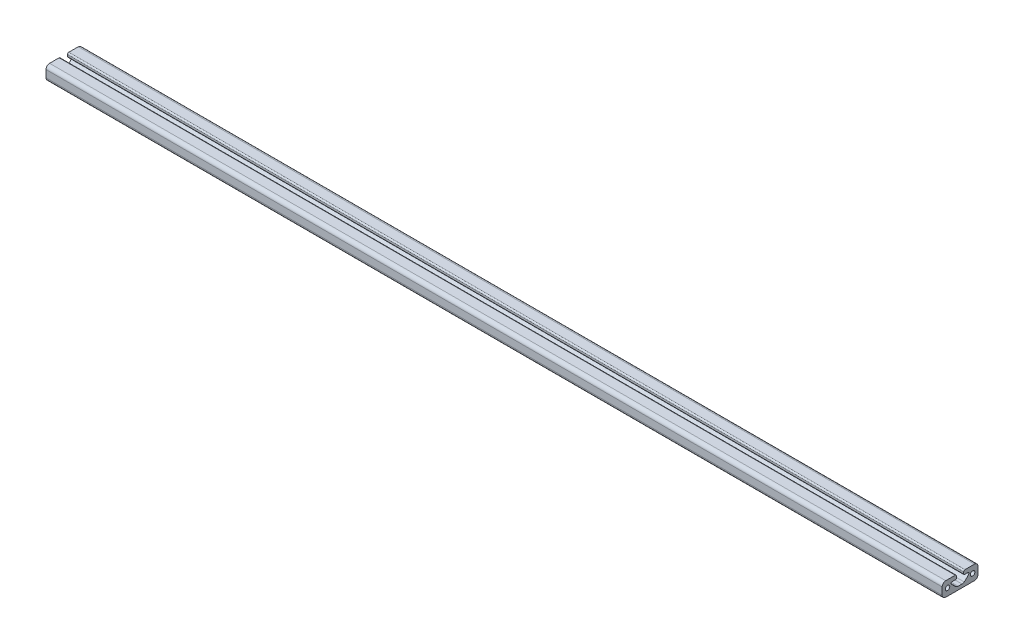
ISO-10303-21;
HEADER;
FILE_DESCRIPTION(('STEP AP214'),'2;1');
FILE_NAME('part.step','',(''),(''),'','','');
FILE_SCHEMA(('AUTOMOTIVE_DESIGN { 1 0 10303 214 1 1 1 1 }'));
ENDSEC;
DATA;
#1=APPLICATION_CONTEXT('core data for automotive mechanical design processes');
#2=APPLICATION_PROTOCOL_DEFINITION('international standard','automotive_design',2000,#1);
#3=PRODUCT_CONTEXT('',#1,'mechanical');
#4=PRODUCT('Part','Part','',(#3));
#5=PRODUCT_RELATED_PRODUCT_CATEGORY('part','',(#4));
#6=PRODUCT_DEFINITION_FORMATION('','',#4);
#7=PRODUCT_DEFINITION_CONTEXT('part definition',#1,'design');
#8=PRODUCT_DEFINITION('design','',#6,#7);
#9=PRODUCT_DEFINITION_SHAPE('','',#8);
#10=(LENGTH_UNIT() NAMED_UNIT(*) SI_UNIT(.MILLI.,.METRE.));
#11=(NAMED_UNIT(*) PLANE_ANGLE_UNIT() SI_UNIT($,.RADIAN.));
#12=(NAMED_UNIT(*) SI_UNIT($,.STERADIAN.) SOLID_ANGLE_UNIT());
#13=UNCERTAINTY_MEASURE_WITH_UNIT(LENGTH_MEASURE(1.E-05),#10,'distance_accuracy_value','');
#14=(GEOMETRIC_REPRESENTATION_CONTEXT(3) GLOBAL_UNCERTAINTY_ASSIGNED_CONTEXT((#13)) GLOBAL_UNIT_ASSIGNED_CONTEXT((#10,
#11,#12)) REPRESENTATION_CONTEXT('',''));
#15=CARTESIAN_POINT('',(0.,0.,0.));
#16=DIRECTION('',(0.,0.,1.));
#17=DIRECTION('',(1.,0.,0.));
#18=AXIS2_PLACEMENT_3D('',#15,#16,#17);
#19=CARTESIAN_POINT('',(1000.,2.41611505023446,8.91611505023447));
#20=DIRECTION('',(-1.,0.,0.));
#21=DIRECTION('',(0.,0.,1.));
#22=AXIS2_PLACEMENT_3D('',#19,#20,#21);
#23=CYLINDRICAL_SURFACE('',#22,1.08388494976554);
#24=CARTESIAN_POINT('',(0.,2.41611505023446,8.91611505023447));
#25=DIRECTION('',(-1.,0.,0.));
#26=DIRECTION('',(0.,0.,-1.));
#27=AXIS2_PLACEMENT_3D('',#24,#25,#26);
#28=CIRCLE('',#27,1.08388494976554);
#29=CARTESIAN_POINT('',(0.,1.77329746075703,9.78880751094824));
#30=VERTEX_POINT('',#29);
#31=CARTESIAN_POINT('',(0.,3.5,8.91611505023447));
#32=VERTEX_POINT('',#31);
#33=EDGE_CURVE('E311',#30,#32,#28,.T.);
#34=ORIENTED_EDGE('',*,*,#33,.T.);
#35=DIRECTION('',(-1.,0.,0.));
#36=VECTOR('',#35,1.);
#37=CARTESIAN_POINT('',(1000.,3.5,8.91611505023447));
#38=LINE('',#37,#36);
#39=CARTESIAN_POINT('',(1000.,3.5,8.91611505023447));
#40=VERTEX_POINT('',#39);
#41=EDGE_CURVE('E12',#40,#32,#38,.T.);
#42=ORIENTED_EDGE('',*,*,#41,.F.);
#43=CARTESIAN_POINT('',(1000.,2.41611505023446,8.91611505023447));
#44=DIRECTION('',(-1.,0.,0.));
#45=DIRECTION('',(0.,0.,-1.));
#46=AXIS2_PLACEMENT_3D('',#43,#44,#45);
#47=CIRCLE('',#46,1.08388494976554);
#48=CARTESIAN_POINT('',(1000.,1.77329746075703,9.78880751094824));
#49=VERTEX_POINT('',#48);
#50=EDGE_CURVE('E484',#49,#40,#47,.T.);
#51=ORIENTED_EDGE('',*,*,#50,.F.);
#52=DIRECTION('',(-1.,0.,0.));
#53=VECTOR('',#52,1.);
#54=CARTESIAN_POINT('',(1000.,1.77329746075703,9.78880751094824));
#55=LINE('',#54,#53);
#56=EDGE_CURVE('E301',#49,#30,#55,.T.);
#57=ORIENTED_EDGE('',*,*,#56,.T.);
#58=EDGE_LOOP('',(#34,#42,#51,#57));
#59=FACE_BOUND('',#58,.T.);
#60=ADVANCED_FACE('F112',(#59),#23,.F.);
#61=CARTESIAN_POINT('',(1000.,3.5,8.91611505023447));
#62=DIRECTION('',(0.,1.,0.));
#63=DIRECTION('',(0.,0.,1.));
#64=AXIS2_PLACEMENT_3D('',#61,#62,#63);
#65=PLANE('',#64);
#66=DIRECTION('',(0.,0.,-1.));
#67=VECTOR('',#66,1.);
#68=CARTESIAN_POINT('',(0.,3.5,8.91611505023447));
#69=LINE('',#68,#67);
#70=CARTESIAN_POINT('',(0.,3.49999999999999,5.));
#71=VERTEX_POINT('',#70);
#72=EDGE_CURVE('E314',#32,#71,#69,.T.);
#73=ORIENTED_EDGE('',*,*,#72,.T.);
#74=DIRECTION('',(-1.,0.,0.));
#75=VECTOR('',#74,1.);
#76=CARTESIAN_POINT('',(1000.,3.49999999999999,5.));
#77=LINE('',#76,#75);
#78=CARTESIAN_POINT('',(1000.,3.49999999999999,5.));
#79=VERTEX_POINT('',#78);
#80=EDGE_CURVE('E121',#79,#71,#77,.T.);
#81=ORIENTED_EDGE('',*,*,#80,.F.);
#82=DIRECTION('',(0.,0.,-1.));
#83=VECTOR('',#82,1.);
#84=CARTESIAN_POINT('',(1000.,3.5,8.91611505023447));
#85=LINE('',#84,#83);
#86=EDGE_CURVE('E220',#40,#79,#85,.T.);
#87=ORIENTED_EDGE('',*,*,#86,.F.);
#88=ORIENTED_EDGE('',*,*,#41,.T.);
#89=EDGE_LOOP('',(#73,#81,#87,#88));
#90=FACE_BOUND('',#89,.T.);
#91=ADVANCED_FACE('F499',(#90),#65,.F.);
#92=CARTESIAN_POINT('',(1000.,4.49999999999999,5.));
#93=DIRECTION('',(-1.,0.,0.));
#94=DIRECTION('',(0.,0.,1.));
#95=AXIS2_PLACEMENT_3D('',#92,#93,#94);
#96=CYLINDRICAL_SURFACE('',#95,1.);
#97=CARTESIAN_POINT('',(0.,4.49999999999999,5.));
#98=DIRECTION('',(1.,0.,0.));
#99=DIRECTION('',(0.,0.,-1.));
#100=AXIS2_PLACEMENT_3D('',#97,#98,#99);
#101=CIRCLE('',#100,1.);
#102=CARTESIAN_POINT('',(0.,4.49999999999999,4.));
#103=VERTEX_POINT('',#102);
#104=EDGE_CURVE('E316',#71,#103,#101,.T.);
#105=ORIENTED_EDGE('',*,*,#104,.T.);
#106=DIRECTION('',(-1.,0.,0.));
#107=VECTOR('',#106,1.);
#108=CARTESIAN_POINT('',(1000.,4.49999999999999,4.));
#109=LINE('',#108,#107);
#110=CARTESIAN_POINT('',(1000.,4.49999999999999,4.));
#111=VERTEX_POINT('',#110);
#112=EDGE_CURVE('E412',#111,#103,#109,.T.);
#113=ORIENTED_EDGE('',*,*,#112,.F.);
#114=CARTESIAN_POINT('',(1000.,4.49999999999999,5.));
#115=DIRECTION('',(1.,0.,0.));
#116=DIRECTION('',(0.,0.,-1.));
#117=AXIS2_PLACEMENT_3D('',#114,#115,#116);
#118=CIRCLE('',#117,1.);
#119=EDGE_CURVE('E420',#79,#111,#118,.T.);
#120=ORIENTED_EDGE('',*,*,#119,.F.);
#121=ORIENTED_EDGE('',*,*,#80,.T.);
#122=EDGE_LOOP('',(#105,#113,#120,#121));
#123=FACE_BOUND('',#122,.T.);
#124=ADVANCED_FACE('F418',(#123),#96,.T.);
#125=CARTESIAN_POINT('',(1000.,4.49999999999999,4.));
#126=DIRECTION('',(0.,0.,1.));
#127=DIRECTION('',(0.,-1.,0.));
#128=AXIS2_PLACEMENT_3D('',#125,#126,#127);
#129=PLANE('',#128);
#130=DIRECTION('',(0.,1.,0.));
#131=VECTOR('',#130,1.);
#132=CARTESIAN_POINT('',(0.,4.49999999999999,4.));
#133=LINE('',#132,#131);
#134=CARTESIAN_POINT('',(0.,6.49999999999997,4.));
#135=VERTEX_POINT('',#134);
#136=EDGE_CURVE('E318',#103,#135,#133,.T.);
#137=ORIENTED_EDGE('',*,*,#136,.T.);
#138=DIRECTION('',(-1.,0.,0.));
#139=VECTOR('',#138,1.);
#140=CARTESIAN_POINT('',(1000.,6.49999999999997,4.));
#141=LINE('',#140,#139);
#142=CARTESIAN_POINT('',(1000.,6.49999999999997,4.));
#143=VERTEX_POINT('',#142);
#144=EDGE_CURVE('E409',#143,#135,#141,.T.);
#145=ORIENTED_EDGE('',*,*,#144,.F.);
#146=DIRECTION('',(0.,1.,0.));
#147=VECTOR('',#146,1.);
#148=CARTESIAN_POINT('',(1000.,4.49999999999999,4.));
#149=LINE('',#148,#147);
#150=EDGE_CURVE('E438',#111,#143,#149,.T.);
#151=ORIENTED_EDGE('',*,*,#150,.F.);
#152=ORIENTED_EDGE('',*,*,#112,.T.);
#153=EDGE_LOOP('',(#137,#145,#151,#152));
#154=FACE_BOUND('',#153,.T.);
#155=ADVANCED_FACE('F429',(#154),#129,.F.);
#156=CARTESIAN_POINT('',(1000.,6.49999999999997,5.5));
#157=DIRECTION('',(-1.,0.,0.));
#158=DIRECTION('',(0.,0.,1.));
#159=AXIS2_PLACEMENT_3D('',#156,#157,#158);
#160=CYLINDRICAL_SURFACE('',#159,1.5);
#161=CARTESIAN_POINT('',(0.,6.49999999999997,5.5));
#162=DIRECTION('',(1.,0.,0.));
#163=DIRECTION('',(0.,0.,-1.));
#164=AXIS2_PLACEMENT_3D('',#161,#162,#163);
#165=CIRCLE('',#164,1.5);
#166=CARTESIAN_POINT('',(0.,7.99999999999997,5.5));
#167=VERTEX_POINT('',#166);
#168=EDGE_CURVE('E320',#135,#167,#165,.T.);
#169=ORIENTED_EDGE('',*,*,#168,.T.);
#170=DIRECTION('',(-1.,0.,0.));
#171=VECTOR('',#170,1.);
#172=CARTESIAN_POINT('',(1000.,7.99999999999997,5.5));
#173=LINE('',#172,#171);
#174=CARTESIAN_POINT('',(1000.,7.99999999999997,5.5));
#175=VERTEX_POINT('',#174);
#176=EDGE_CURVE('E406',#175,#167,#173,.T.);
#177=ORIENTED_EDGE('',*,*,#176,.F.);
#178=CARTESIAN_POINT('',(1000.,6.49999999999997,5.5));
#179=DIRECTION('',(1.,0.,0.));
#180=DIRECTION('',(0.,0.,-1.));
#181=AXIS2_PLACEMENT_3D('',#178,#179,#180);
#182=CIRCLE('',#181,1.5);
#183=EDGE_CURVE('E435',#143,#175,#182,.T.);
#184=ORIENTED_EDGE('',*,*,#183,.F.);
#185=ORIENTED_EDGE('',*,*,#144,.T.);
#186=EDGE_LOOP('',(#169,#177,#184,#185));
#187=FACE_BOUND('',#186,.T.);
#188=ADVANCED_FACE('F433',(#187),#160,.T.);
#189=CARTESIAN_POINT('',(1000.,7.99999999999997,5.5));
#190=DIRECTION('',(0.,-1.,0.));
#191=DIRECTION('',(0.,0.,-1.));
#192=AXIS2_PLACEMENT_3D('',#189,#190,#191);
#193=PLANE('',#192);
#194=DIRECTION('',(0.,0.,1.));
#195=VECTOR('',#194,1.);
#196=CARTESIAN_POINT('',(0.,7.99999999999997,5.5));
#197=LINE('',#196,#195);
#198=CARTESIAN_POINT('',(0.,8.,16.));
#199=VERTEX_POINT('',#198);
#200=EDGE_CURVE('E322',#167,#199,#197,.T.);
#201=ORIENTED_EDGE('',*,*,#200,.T.);
#202=DIRECTION('',(-1.,0.,0.));
#203=VECTOR('',#202,1.);
#204=CARTESIAN_POINT('',(1000.,8.,16.));
#205=LINE('',#204,#203);
#206=CARTESIAN_POINT('',(1000.,8.,16.));
#207=VERTEX_POINT('',#206);
#208=EDGE_CURVE('E403',#207,#199,#205,.T.);
#209=ORIENTED_EDGE('',*,*,#208,.F.);
#210=DIRECTION('',(0.,0.,1.));
#211=VECTOR('',#210,1.);
#212=CARTESIAN_POINT('',(1000.,7.99999999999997,5.5));
#213=LINE('',#212,#211);
#214=EDGE_CURVE('E437',#175,#207,#213,.T.);
#215=ORIENTED_EDGE('',*,*,#214,.F.);
#216=ORIENTED_EDGE('',*,*,#176,.T.);
#217=EDGE_LOOP('',(#201,#209,#215,#216));
#218=FACE_BOUND('',#217,.T.);
#219=ADVANCED_FACE('F721',(#218),#193,.F.);
#220=CARTESIAN_POINT('',(1000.,4.,16.));
#221=DIRECTION('',(-1.,0.,0.));
#222=DIRECTION('',(0.,0.,1.));
#223=AXIS2_PLACEMENT_3D('',#220,#221,#222);
#224=CYLINDRICAL_SURFACE('',#223,4.);
#225=CARTESIAN_POINT('',(0.,4.,16.));
#226=DIRECTION('',(1.,0.,0.));
#227=DIRECTION('',(0.,0.,-1.));
#228=AXIS2_PLACEMENT_3D('',#225,#226,#227);
#229=CIRCLE('',#228,4.);
#230=CARTESIAN_POINT('',(0.,4.,20.));
#231=VERTEX_POINT('',#230);
#232=EDGE_CURVE('E324',#199,#231,#229,.T.);
#233=ORIENTED_EDGE('',*,*,#232,.T.);
#234=DIRECTION('',(-1.,0.,0.));
#235=VECTOR('',#234,1.);
#236=CARTESIAN_POINT('',(1000.,4.,20.));
#237=LINE('',#236,#235);
#238=CARTESIAN_POINT('',(1000.,4.,20.));
#239=VERTEX_POINT('',#238);
#240=EDGE_CURVE('E400',#239,#231,#237,.T.);
#241=ORIENTED_EDGE('',*,*,#240,.F.);
#242=CARTESIAN_POINT('',(1000.,4.,16.));
#243=DIRECTION('',(1.,0.,0.));
#244=DIRECTION('',(0.,0.,-1.));
#245=AXIS2_PLACEMENT_3D('',#242,#243,#244);
#246=CIRCLE('',#245,4.);
#247=EDGE_CURVE('E440',#207,#239,#246,.T.);
#248=ORIENTED_EDGE('',*,*,#247,.F.);
#249=ORIENTED_EDGE('',*,*,#208,.T.);
#250=EDGE_LOOP('',(#233,#241,#248,#249));
#251=FACE_BOUND('',#250,.T.);
#252=ADVANCED_FACE('F710',(#251),#224,.T.);
#253=CARTESIAN_POINT('',(1000.,4.,20.));
#254=DIRECTION('',(0.,0.,-1.));
#255=DIRECTION('',(-1.,0.,0.));
#256=AXIS2_PLACEMENT_3D('',#253,#254,#255);
#257=PLANE('',#256);
#258=DIRECTION('',(0.,-1.,0.));
#259=VECTOR('',#258,1.);
#260=CARTESIAN_POINT('',(0.,4.,20.));
#261=LINE('',#260,#259);
#262=CARTESIAN_POINT('',(0.,-4.,20.));
#263=VERTEX_POINT('',#262);
#264=EDGE_CURVE('E326',#231,#263,#261,.T.);
#265=ORIENTED_EDGE('',*,*,#264,.T.);
#266=DIRECTION('',(-1.,0.,0.));
#267=VECTOR('',#266,1.);
#268=CARTESIAN_POINT('',(1000.,-4.,20.));
#269=LINE('',#268,#267);
#270=CARTESIAN_POINT('',(1000.,-4.,20.));
#271=VERTEX_POINT('',#270);
#272=EDGE_CURVE('E397',#271,#263,#269,.T.);
#273=ORIENTED_EDGE('',*,*,#272,.F.);
#274=DIRECTION('',(0.,-1.,0.));
#275=VECTOR('',#274,1.);
#276=CARTESIAN_POINT('',(1000.,4.,20.));
#277=LINE('',#276,#275);
#278=EDGE_CURVE('E446',#239,#271,#277,.T.);
#279=ORIENTED_EDGE('',*,*,#278,.F.);
#280=ORIENTED_EDGE('',*,*,#240,.T.);
#281=EDGE_LOOP('',(#265,#273,#279,#280));
#282=FACE_BOUND('',#281,.T.);
#283=ADVANCED_FACE('F699',(#282),#257,.F.);
#284=CARTESIAN_POINT('',(1000.,-4.,16.));
#285=DIRECTION('',(-1.,0.,0.));
#286=DIRECTION('',(0.,0.,1.));
#287=AXIS2_PLACEMENT_3D('',#284,#285,#286);
#288=CYLINDRICAL_SURFACE('',#287,4.);
#289=CARTESIAN_POINT('',(0.,-4.,16.));
#290=DIRECTION('',(1.,0.,0.));
#291=DIRECTION('',(0.,0.,-1.));
#292=AXIS2_PLACEMENT_3D('',#289,#290,#291);
#293=CIRCLE('',#292,4.);
#294=CARTESIAN_POINT('',(0.,-8.,16.));
#295=VERTEX_POINT('',#294);
#296=EDGE_CURVE('E328',#263,#295,#293,.T.);
#297=ORIENTED_EDGE('',*,*,#296,.T.);
#298=DIRECTION('',(-1.,0.,0.));
#299=VECTOR('',#298,1.);
#300=CARTESIAN_POINT('',(1000.,-8.,16.));
#301=LINE('',#300,#299);
#302=CARTESIAN_POINT('',(1000.,-8.,16.));
#303=VERTEX_POINT('',#302);
#304=EDGE_CURVE('E394',#303,#295,#301,.T.);
#305=ORIENTED_EDGE('',*,*,#304,.F.);
#306=CARTESIAN_POINT('',(1000.,-4.,16.));
#307=DIRECTION('',(1.,0.,0.));
#308=DIRECTION('',(0.,0.,-1.));
#309=AXIS2_PLACEMENT_3D('',#306,#307,#308);
#310=CIRCLE('',#309,4.);
#311=EDGE_CURVE('E448',#271,#303,#310,.T.);
#312=ORIENTED_EDGE('',*,*,#311,.F.);
#313=ORIENTED_EDGE('',*,*,#272,.T.);
#314=EDGE_LOOP('',(#297,#305,#312,#313));
#315=FACE_BOUND('',#314,.T.);
#316=ADVANCED_FACE('F688',(#315),#288,.T.);
#317=CARTESIAN_POINT('',(1000.,-8.,16.));
#318=DIRECTION('',(0.,1.,0.));
#319=DIRECTION('',(0.,0.,1.));
#320=AXIS2_PLACEMENT_3D('',#317,#318,#319);
#321=PLANE('',#320);
#322=DIRECTION('',(0.,0.,-1.));
#323=VECTOR('',#322,1.);
#324=CARTESIAN_POINT('',(0.,-8.,16.));
#325=LINE('',#324,#323);
#326=CARTESIAN_POINT('',(0.,-8.,-16.));
#327=VERTEX_POINT('',#326);
#328=EDGE_CURVE('E330',#295,#327,#325,.T.);
#329=ORIENTED_EDGE('',*,*,#328,.T.);
#330=DIRECTION('',(-1.,0.,0.));
#331=VECTOR('',#330,1.);
#332=CARTESIAN_POINT('',(1000.,-8.,-16.));
#333=LINE('',#332,#331);
#334=CARTESIAN_POINT('',(1000.,-8.,-16.));
#335=VERTEX_POINT('',#334);
#336=EDGE_CURVE('E391',#335,#327,#333,.T.);
#337=ORIENTED_EDGE('',*,*,#336,.F.);
#338=DIRECTION('',(0.,0.,-1.));
#339=VECTOR('',#338,1.);
#340=CARTESIAN_POINT('',(1000.,-8.,16.));
#341=LINE('',#340,#339);
#342=EDGE_CURVE('E450',#303,#335,#341,.T.);
#343=ORIENTED_EDGE('',*,*,#342,.F.);
#344=ORIENTED_EDGE('',*,*,#304,.T.);
#345=EDGE_LOOP('',(#329,#337,#343,#344));
#346=FACE_BOUND('',#345,.T.);
#347=ADVANCED_FACE('F677',(#346),#321,.F.);
#348=CARTESIAN_POINT('',(1000.,-4.,-16.));
#349=DIRECTION('',(-1.,0.,0.));
#350=DIRECTION('',(0.,0.,1.));
#351=AXIS2_PLACEMENT_3D('',#348,#349,#350);
#352=CYLINDRICAL_SURFACE('',#351,4.);
#353=CARTESIAN_POINT('',(0.,-4.,-16.));
#354=DIRECTION('',(1.,0.,0.));
#355=DIRECTION('',(0.,0.,-1.));
#356=AXIS2_PLACEMENT_3D('',#353,#354,#355);
#357=CIRCLE('',#356,4.);
#358=CARTESIAN_POINT('',(0.,-4.,-20.));
#359=VERTEX_POINT('',#358);
#360=EDGE_CURVE('E332',#327,#359,#357,.T.);
#361=ORIENTED_EDGE('',*,*,#360,.T.);
#362=DIRECTION('',(-1.,0.,0.));
#363=VECTOR('',#362,1.);
#364=CARTESIAN_POINT('',(1000.,-4.,-20.));
#365=LINE('',#364,#363);
#366=CARTESIAN_POINT('',(1000.,-4.,-20.));
#367=VERTEX_POINT('',#366);
#368=EDGE_CURVE('E388',#367,#359,#365,.T.);
#369=ORIENTED_EDGE('',*,*,#368,.F.);
#370=CARTESIAN_POINT('',(1000.,-4.,-16.));
#371=DIRECTION('',(1.,0.,0.));
#372=DIRECTION('',(0.,0.,-1.));
#373=AXIS2_PLACEMENT_3D('',#370,#371,#372);
#374=CIRCLE('',#373,4.);
#375=EDGE_CURVE('E452',#335,#367,#374,.T.);
#376=ORIENTED_EDGE('',*,*,#375,.F.);
#377=ORIENTED_EDGE('',*,*,#336,.T.);
#378=EDGE_LOOP('',(#361,#369,#376,#377));
#379=FACE_BOUND('',#378,.T.);
#380=ADVANCED_FACE('F666',(#379),#352,.T.);
#381=CARTESIAN_POINT('',(1000.,-4.,-20.));
#382=DIRECTION('',(0.,0.,1.));
#383=DIRECTION('',(1.,0.,0.));
#384=AXIS2_PLACEMENT_3D('',#381,#382,#383);
#385=PLANE('',#384);
#386=DIRECTION('',(0.,1.,0.));
#387=VECTOR('',#386,1.);
#388=CARTESIAN_POINT('',(0.,-4.,-20.));
#389=LINE('',#388,#387);
#390=CARTESIAN_POINT('',(0.,4.,-20.));
#391=VERTEX_POINT('',#390);
#392=EDGE_CURVE('E334',#359,#391,#389,.T.);
#393=ORIENTED_EDGE('',*,*,#392,.T.);
#394=DIRECTION('',(-1.,0.,0.));
#395=VECTOR('',#394,1.);
#396=CARTESIAN_POINT('',(1000.,4.,-20.));
#397=LINE('',#396,#395);
#398=CARTESIAN_POINT('',(1000.,4.,-20.));
#399=VERTEX_POINT('',#398);
#400=EDGE_CURVE('E385',#399,#391,#397,.T.);
#401=ORIENTED_EDGE('',*,*,#400,.F.);
#402=DIRECTION('',(0.,1.,0.));
#403=VECTOR('',#402,1.);
#404=CARTESIAN_POINT('',(1000.,-4.,-20.));
#405=LINE('',#404,#403);
#406=EDGE_CURVE('E454',#367,#399,#405,.T.);
#407=ORIENTED_EDGE('',*,*,#406,.F.);
#408=ORIENTED_EDGE('',*,*,#368,.T.);
#409=EDGE_LOOP('',(#393,#401,#407,#408));
#410=FACE_BOUND('',#409,.T.);
#411=ADVANCED_FACE('F655',(#410),#385,.F.);
#412=CARTESIAN_POINT('',(1000.,4.,-16.));
#413=DIRECTION('',(-1.,0.,0.));
#414=DIRECTION('',(0.,0.,1.));
#415=AXIS2_PLACEMENT_3D('',#412,#413,#414);
#416=CYLINDRICAL_SURFACE('',#415,4.);
#417=CARTESIAN_POINT('',(0.,4.,-16.));
#418=DIRECTION('',(1.,0.,0.));
#419=DIRECTION('',(0.,0.,-1.));
#420=AXIS2_PLACEMENT_3D('',#417,#418,#419);
#421=CIRCLE('',#420,4.);
#422=CARTESIAN_POINT('',(0.,8.,-16.));
#423=VERTEX_POINT('',#422);
#424=EDGE_CURVE('E336',#391,#423,#421,.T.);
#425=ORIENTED_EDGE('',*,*,#424,.T.);
#426=DIRECTION('',(-1.,0.,0.));
#427=VECTOR('',#426,1.);
#428=CARTESIAN_POINT('',(1000.,8.,-16.));
#429=LINE('',#428,#427);
#430=CARTESIAN_POINT('',(1000.,8.,-16.));
#431=VERTEX_POINT('',#430);
#432=EDGE_CURVE('E382',#431,#423,#429,.T.);
#433=ORIENTED_EDGE('',*,*,#432,.F.);
#434=CARTESIAN_POINT('',(1000.,4.,-16.));
#435=DIRECTION('',(1.,0.,0.));
#436=DIRECTION('',(0.,0.,-1.));
#437=AXIS2_PLACEMENT_3D('',#434,#435,#436);
#438=CIRCLE('',#437,4.);
#439=EDGE_CURVE('E456',#399,#431,#438,.T.);
#440=ORIENTED_EDGE('',*,*,#439,.F.);
#441=ORIENTED_EDGE('',*,*,#400,.T.);
#442=EDGE_LOOP('',(#425,#433,#440,#441));
#443=FACE_BOUND('',#442,.T.);
#444=ADVANCED_FACE('F644',(#443),#416,.T.);
#445=CARTESIAN_POINT('',(1000.,8.,-16.));
#446=DIRECTION('',(0.,-1.,0.));
#447=DIRECTION('',(0.,0.,-1.));
#448=AXIS2_PLACEMENT_3D('',#445,#446,#447);
#449=PLANE('',#448);
#450=DIRECTION('',(0.,0.,1.));
#451=VECTOR('',#450,1.);
#452=CARTESIAN_POINT('',(0.,8.,-16.));
#453=LINE('',#452,#451);
#454=CARTESIAN_POINT('',(0.,8.,-5.49999999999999));
#455=VERTEX_POINT('',#454);
#456=EDGE_CURVE('E338',#423,#455,#453,.T.);
#457=ORIENTED_EDGE('',*,*,#456,.T.);
#458=DIRECTION('',(-1.,0.,0.));
#459=VECTOR('',#458,1.);
#460=CARTESIAN_POINT('',(1000.,8.,-5.49999999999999));
#461=LINE('',#460,#459);
#462=CARTESIAN_POINT('',(1000.,8.,-5.49999999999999));
#463=VERTEX_POINT('',#462);
#464=EDGE_CURVE('E379',#463,#455,#461,.T.);
#465=ORIENTED_EDGE('',*,*,#464,.F.);
#466=DIRECTION('',(0.,0.,1.));
#467=VECTOR('',#466,1.);
#468=CARTESIAN_POINT('',(1000.,8.,-16.));
#469=LINE('',#468,#467);
#470=EDGE_CURVE('E458',#431,#463,#469,.T.);
#471=ORIENTED_EDGE('',*,*,#470,.F.);
#472=ORIENTED_EDGE('',*,*,#432,.T.);
#473=EDGE_LOOP('',(#457,#465,#471,#472));
#474=FACE_BOUND('',#473,.T.);
#475=ADVANCED_FACE('F633',(#474),#449,.F.);
#476=CARTESIAN_POINT('',(1000.,6.49999999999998,-5.50000000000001));
#477=DIRECTION('',(-1.,0.,0.));
#478=DIRECTION('',(0.,0.,1.));
#479=AXIS2_PLACEMENT_3D('',#476,#477,#478);
#480=CYLINDRICAL_SURFACE('',#479,1.50000000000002);
#481=CARTESIAN_POINT('',(0.,6.49999999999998,-5.50000000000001));
#482=DIRECTION('',(1.,0.,0.));
#483=DIRECTION('',(0.,0.,-1.));
#484=AXIS2_PLACEMENT_3D('',#481,#482,#483);
#485=CIRCLE('',#484,1.50000000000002);
#486=CARTESIAN_POINT('',(0.,6.49999999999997,-3.99999999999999));
#487=VERTEX_POINT('',#486);
#488=EDGE_CURVE('E340',#455,#487,#485,.T.);
#489=ORIENTED_EDGE('',*,*,#488,.T.);
#490=DIRECTION('',(-1.,0.,0.));
#491=VECTOR('',#490,1.);
#492=CARTESIAN_POINT('',(1000.,6.49999999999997,-3.99999999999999));
#493=LINE('',#492,#491);
#494=CARTESIAN_POINT('',(1000.,6.49999999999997,-3.99999999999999));
#495=VERTEX_POINT('',#494);
#496=EDGE_CURVE('E376',#495,#487,#493,.T.);
#497=ORIENTED_EDGE('',*,*,#496,.F.);
#498=CARTESIAN_POINT('',(1000.,6.49999999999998,-5.50000000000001));
#499=DIRECTION('',(1.,0.,0.));
#500=DIRECTION('',(0.,0.,-1.));
#501=AXIS2_PLACEMENT_3D('',#498,#499,#500);
#502=CIRCLE('',#501,1.50000000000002);
#503=EDGE_CURVE('E460',#463,#495,#502,.T.);
#504=ORIENTED_EDGE('',*,*,#503,.F.);
#505=ORIENTED_EDGE('',*,*,#464,.T.);
#506=EDGE_LOOP('',(#489,#497,#504,#505));
#507=FACE_BOUND('',#506,.T.);
#508=ADVANCED_FACE('F622',(#507),#480,.T.);
#509=CARTESIAN_POINT('',(1000.,6.49999999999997,-3.99999999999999));
#510=DIRECTION('',(0.,0.,-1.));
#511=DIRECTION('',(0.,1.,0.));
#512=AXIS2_PLACEMENT_3D('',#509,#510,#511);
#513=PLANE('',#512);
#514=DIRECTION('',(0.,-1.,0.));
#515=VECTOR('',#514,1.);
#516=CARTESIAN_POINT('',(0.,6.49999999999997,-3.99999999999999));
#517=LINE('',#516,#515);
#518=CARTESIAN_POINT('',(0.,4.49999999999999,-4.));
#519=VERTEX_POINT('',#518);
#520=EDGE_CURVE('E342',#487,#519,#517,.T.);
#521=ORIENTED_EDGE('',*,*,#520,.T.);
#522=DIRECTION('',(-1.,0.,0.));
#523=VECTOR('',#522,1.);
#524=CARTESIAN_POINT('',(1000.,4.49999999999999,-4.));
#525=LINE('',#524,#523);
#526=CARTESIAN_POINT('',(1000.,4.49999999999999,-4.));
#527=VERTEX_POINT('',#526);
#528=EDGE_CURVE('E373',#527,#519,#525,.T.);
#529=ORIENTED_EDGE('',*,*,#528,.F.);
#530=DIRECTION('',(0.,-1.,0.));
#531=VECTOR('',#530,1.);
#532=CARTESIAN_POINT('',(1000.,6.49999999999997,-3.99999999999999));
#533=LINE('',#532,#531);
#534=EDGE_CURVE('E462',#495,#527,#533,.T.);
#535=ORIENTED_EDGE('',*,*,#534,.F.);
#536=ORIENTED_EDGE('',*,*,#496,.T.);
#537=EDGE_LOOP('',(#521,#529,#535,#536));
#538=FACE_BOUND('',#537,.T.);
#539=ADVANCED_FACE('F611',(#538),#513,.F.);
#540=CARTESIAN_POINT('',(1000.,4.49999999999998,-5.));
#541=DIRECTION('',(-1.,0.,0.));
#542=DIRECTION('',(0.,0.,1.));
#543=AXIS2_PLACEMENT_3D('',#540,#541,#542);
#544=CYLINDRICAL_SURFACE('',#543,0.999999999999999);
#545=CARTESIAN_POINT('',(0.,4.49999999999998,-5.));
#546=DIRECTION('',(1.,0.,0.));
#547=DIRECTION('',(0.,0.,-1.));
#548=AXIS2_PLACEMENT_3D('',#545,#546,#547);
#549=CIRCLE('',#548,0.999999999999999);
#550=CARTESIAN_POINT('',(0.,3.49999999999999,-5.));
#551=VERTEX_POINT('',#550);
#552=EDGE_CURVE('E344',#519,#551,#549,.T.);
#553=ORIENTED_EDGE('',*,*,#552,.T.);
#554=DIRECTION('',(-1.,0.,0.));
#555=VECTOR('',#554,1.);
#556=CARTESIAN_POINT('',(1000.,3.49999999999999,-5.));
#557=LINE('',#556,#555);
#558=CARTESIAN_POINT('',(1000.,3.49999999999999,-5.));
#559=VERTEX_POINT('',#558);
#560=EDGE_CURVE('E370',#559,#551,#557,.T.);
#561=ORIENTED_EDGE('',*,*,#560,.F.);
#562=CARTESIAN_POINT('',(1000.,4.49999999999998,-5.));
#563=DIRECTION('',(1.,0.,0.));
#564=DIRECTION('',(0.,0.,-1.));
#565=AXIS2_PLACEMENT_3D('',#562,#563,#564);
#566=CIRCLE('',#565,0.999999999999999);
#567=EDGE_CURVE('E464',#527,#559,#566,.T.);
#568=ORIENTED_EDGE('',*,*,#567,.F.);
#569=ORIENTED_EDGE('',*,*,#528,.T.);
#570=EDGE_LOOP('',(#553,#561,#568,#569));
#571=FACE_BOUND('',#570,.T.);
#572=ADVANCED_FACE('F600',(#571),#544,.T.);
#573=CARTESIAN_POINT('',(1000.,3.49999999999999,-5.));
#574=DIRECTION('',(0.,1.,0.));
#575=DIRECTION('',(0.,0.,1.));
#576=AXIS2_PLACEMENT_3D('',#573,#574,#575);
#577=PLANE('',#576);
#578=DIRECTION('',(0.,0.,-1.));
#579=VECTOR('',#578,1.);
#580=CARTESIAN_POINT('',(0.,3.49999999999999,-5.));
#581=LINE('',#580,#579);
#582=CARTESIAN_POINT('',(0.,3.5,-8.91611505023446));
#583=VERTEX_POINT('',#582);
#584=EDGE_CURVE('E346',#551,#583,#581,.T.);
#585=ORIENTED_EDGE('',*,*,#584,.T.);
#586=DIRECTION('',(-1.,0.,0.));
#587=VECTOR('',#586,1.);
#588=CARTESIAN_POINT('',(1000.,3.5,-8.91611505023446));
#589=LINE('',#588,#587);
#590=CARTESIAN_POINT('',(1000.,3.5,-8.91611505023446));
#591=VERTEX_POINT('',#590);
#592=EDGE_CURVE('E367',#591,#583,#589,.T.);
#593=ORIENTED_EDGE('',*,*,#592,.F.);
#594=DIRECTION('',(0.,0.,-1.));
#595=VECTOR('',#594,1.);
#596=CARTESIAN_POINT('',(1000.,3.49999999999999,-5.));
#597=LINE('',#596,#595);
#598=EDGE_CURVE('E466',#559,#591,#597,.T.);
#599=ORIENTED_EDGE('',*,*,#598,.F.);
#600=ORIENTED_EDGE('',*,*,#560,.T.);
#601=EDGE_LOOP('',(#585,#593,#599,#600));
#602=FACE_BOUND('',#601,.T.);
#603=ADVANCED_FACE('F589',(#602),#577,.F.);
#604=CARTESIAN_POINT('',(1000.,2.41611505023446,-8.91611505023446));
#605=DIRECTION('',(-1.,0.,0.));
#606=DIRECTION('',(0.,0.,1.));
#607=AXIS2_PLACEMENT_3D('',#604,#605,#606);
#608=CYLINDRICAL_SURFACE('',#607,1.08388494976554);
#609=CARTESIAN_POINT('',(0.,2.41611505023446,-8.91611505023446));
#610=DIRECTION('',(-1.,0.,0.));
#611=DIRECTION('',(0.,0.,-1.));
#612=AXIS2_PLACEMENT_3D('',#609,#610,#611);
#613=CIRCLE('',#612,1.08388494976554);
#614=CARTESIAN_POINT('',(0.,1.77329746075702,-9.78880751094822));
#615=VERTEX_POINT('',#614);
#616=EDGE_CURVE('E348',#583,#615,#613,.T.);
#617=ORIENTED_EDGE('',*,*,#616,.T.);
#618=DIRECTION('',(-1.,0.,0.));
#619=VECTOR('',#618,1.);
#620=CARTESIAN_POINT('',(1000.,1.77329746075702,-9.78880751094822));
#621=LINE('',#620,#619);
#622=CARTESIAN_POINT('',(1000.,1.77329746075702,-9.78880751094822));
#623=VERTEX_POINT('',#622);
#624=EDGE_CURVE('E364',#623,#615,#621,.T.);
#625=ORIENTED_EDGE('',*,*,#624,.F.);
#626=CARTESIAN_POINT('',(1000.,2.41611505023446,-8.91611505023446));
#627=DIRECTION('',(-1.,0.,0.));
#628=DIRECTION('',(0.,0.,-1.));
#629=AXIS2_PLACEMENT_3D('',#626,#627,#628);
#630=CIRCLE('',#629,1.08388494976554);
#631=EDGE_CURVE('E468',#591,#623,#630,.T.);
#632=ORIENTED_EDGE('',*,*,#631,.F.);
#633=ORIENTED_EDGE('',*,*,#592,.T.);
#634=EDGE_LOOP('',(#617,#625,#632,#633));
#635=FACE_BOUND('',#634,.T.);
#636=ADVANCED_FACE('F579',(#635),#608,.F.);
#637=CARTESIAN_POINT('',(1000.,16.6,10.34));
#638=DIRECTION('',(-1.,0.,0.));
#639=DIRECTION('',(0.,0.,1.));
#640=AXIS2_PLACEMENT_3D('',#637,#638,#639);
#641=CYLINDRICAL_SURFACE('',#640,25.);
#642=CARTESIAN_POINT('',(0.,16.6,10.34));
#643=DIRECTION('',(-1.,0.,0.));
#644=DIRECTION('',(0.,0.,-1.));
#645=AXIS2_PLACEMENT_3D('',#642,#643,#644);
#646=CIRCLE('',#645,25.);
#647=CARTESIAN_POINT('',(0.,-3.45952380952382,-4.58030510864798));
#648=VERTEX_POINT('',#647);
#649=EDGE_CURVE('E350',#615,#648,#646,.T.);
#650=ORIENTED_EDGE('',*,*,#649,.T.);
#651=DIRECTION('',(-1.,0.,0.));
#652=VECTOR('',#651,1.);
#653=CARTESIAN_POINT('',(1000.,-3.45952380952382,-4.58030510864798));
#654=LINE('',#653,#652);
#655=CARTESIAN_POINT('',(1000.,-3.45952380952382,-4.58030510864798));
#656=VERTEX_POINT('',#655);
#657=EDGE_CURVE('E361',#656,#648,#654,.T.);
#658=ORIENTED_EDGE('',*,*,#657,.F.);
#659=CARTESIAN_POINT('',(1000.,16.6,10.34));
#660=DIRECTION('',(-1.,0.,0.));
#661=DIRECTION('',(0.,0.,-1.));
#662=AXIS2_PLACEMENT_3D('',#659,#660,#661);
#663=CIRCLE('',#662,25.);
#664=EDGE_CURVE('E470',#623,#656,#663,.T.);
#665=ORIENTED_EDGE('',*,*,#664,.F.);
#666=ORIENTED_EDGE('',*,*,#624,.T.);
#667=EDGE_LOOP('',(#650,#658,#665,#666));
#668=FACE_BOUND('',#667,.T.);
#669=ADVANCED_FACE('F476',(#668),#641,.F.);
#670=CARTESIAN_POINT('',(1000.,-0.25000000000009,-2.19305629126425));
#671=DIRECTION('',(-1.,0.,0.));
#672=DIRECTION('',(0.,0.,1.));
#673=AXIS2_PLACEMENT_3D('',#670,#671,#672);
#674=CYLINDRICAL_SURFACE('',#673,3.99999999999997);
#675=CARTESIAN_POINT('',(0.,-0.25000000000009,-2.19305629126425));
#676=DIRECTION('',(-1.,0.,0.));
#677=DIRECTION('',(0.,0.,-1.));
#678=AXIS2_PLACEMENT_3D('',#675,#676,#677);
#679=CIRCLE('',#678,3.99999999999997);
#680=CARTESIAN_POINT('',(0.,-4.25000000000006,-2.19305629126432));
#681=VERTEX_POINT('',#680);
#682=EDGE_CURVE('E352',#648,#681,#679,.T.);
#683=ORIENTED_EDGE('',*,*,#682,.T.);
#684=DIRECTION('',(-1.,0.,0.));
#685=VECTOR('',#684,1.);
#686=CARTESIAN_POINT('',(1000.,-4.25000000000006,-2.19305629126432));
#687=LINE('',#686,#685);
#688=CARTESIAN_POINT('',(1000.,-4.25000000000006,-2.19305629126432));
#689=VERTEX_POINT('',#688);
#690=EDGE_CURVE('E296',#689,#681,#687,.T.);
#691=ORIENTED_EDGE('',*,*,#690,.F.);
#692=CARTESIAN_POINT('',(1000.,-0.25000000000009,-2.19305629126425));
#693=DIRECTION('',(-1.,0.,0.));
#694=DIRECTION('',(0.,0.,-1.));
#695=AXIS2_PLACEMENT_3D('',#692,#693,#694);
#696=CIRCLE('',#695,3.99999999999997);
#697=EDGE_CURVE('E287',#656,#689,#696,.T.);
#698=ORIENTED_EDGE('',*,*,#697,.F.);
#699=ORIENTED_EDGE('',*,*,#657,.T.);
#700=EDGE_LOOP('',(#683,#691,#698,#699));
#701=FACE_BOUND('',#700,.T.);
#702=ADVANCED_FACE('F480',(#701),#674,.F.);
#703=CARTESIAN_POINT('',(1000.,-4.25000000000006,-2.19305629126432));
#704=DIRECTION('',(0.,-1.,0.));
#705=DIRECTION('',(0.,0.,-1.));
#706=AXIS2_PLACEMENT_3D('',#703,#704,#705);
#707=PLANE('',#706);
#708=DIRECTION('',(0.,0.,1.));
#709=VECTOR('',#708,1.);
#710=CARTESIAN_POINT('',(0.,-4.25000000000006,-2.19305629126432));
#711=LINE('',#710,#709);
#712=CARTESIAN_POINT('',(0.,-4.25,2.19305629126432));
#713=VERTEX_POINT('',#712);
#714=EDGE_CURVE('E295',#681,#713,#711,.T.);
#715=ORIENTED_EDGE('',*,*,#714,.T.);
#716=DIRECTION('',(-1.,0.,0.));
#717=VECTOR('',#716,1.);
#718=CARTESIAN_POINT('',(1000.,-4.25,2.19305629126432));
#719=LINE('',#718,#717);
#720=CARTESIAN_POINT('',(1000.,-4.25,2.19305629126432));
#721=VERTEX_POINT('',#720);
#722=EDGE_CURVE('E292',#721,#713,#719,.T.);
#723=ORIENTED_EDGE('',*,*,#722,.F.);
#724=DIRECTION('',(0.,0.,1.));
#725=VECTOR('',#724,1.);
#726=CARTESIAN_POINT('',(1000.,-4.25000000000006,-2.19305629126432));
#727=LINE('',#726,#725);
#728=EDGE_CURVE('E281',#689,#721,#727,.T.);
#729=ORIENTED_EDGE('',*,*,#728,.F.);
#730=ORIENTED_EDGE('',*,*,#690,.T.);
#731=EDGE_LOOP('',(#715,#723,#729,#730));
#732=FACE_BOUND('',#731,.T.);
#733=ADVANCED_FACE('F293',(#732),#707,.F.);
#734=CARTESIAN_POINT('',(1000.,-0.250000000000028,2.19305629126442));
#735=DIRECTION('',(-1.,0.,0.));
#736=DIRECTION('',(0.,0.,1.));
#737=AXIS2_PLACEMENT_3D('',#734,#735,#736);
#738=CYLINDRICAL_SURFACE('',#737,3.99999999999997);
#739=CARTESIAN_POINT('',(0.,-0.250000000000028,2.19305629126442));
#740=DIRECTION('',(-1.,0.,0.));
#741=DIRECTION('',(0.,0.,-1.));
#742=AXIS2_PLACEMENT_3D('',#739,#740,#741);
#743=CIRCLE('',#742,3.99999999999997);
#744=CARTESIAN_POINT('',(0.,-3.45952380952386,4.58030510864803));
#745=VERTEX_POINT('',#744);
#746=EDGE_CURVE('E206',#713,#745,#743,.T.);
#747=ORIENTED_EDGE('',*,*,#746,.T.);
#748=DIRECTION('',(-1.,0.,0.));
#749=VECTOR('',#748,1.);
#750=CARTESIAN_POINT('',(1000.,-3.45952380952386,4.58030510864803));
#751=LINE('',#750,#749);
#752=CARTESIAN_POINT('',(1000.,-3.45952380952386,4.58030510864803));
#753=VERTEX_POINT('',#752);
#754=EDGE_CURVE('E297',#753,#745,#751,.T.);
#755=ORIENTED_EDGE('',*,*,#754,.F.);
#756=CARTESIAN_POINT('',(1000.,-0.250000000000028,2.19305629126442));
#757=DIRECTION('',(-1.,0.,0.));
#758=DIRECTION('',(0.,0.,-1.));
#759=AXIS2_PLACEMENT_3D('',#756,#757,#758);
#760=CIRCLE('',#759,3.99999999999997);
#761=EDGE_CURVE('E285',#721,#753,#760,.T.);
#762=ORIENTED_EDGE('',*,*,#761,.F.);
#763=ORIENTED_EDGE('',*,*,#722,.T.);
#764=EDGE_LOOP('',(#747,#755,#762,#763));
#765=FACE_BOUND('',#764,.T.);
#766=ADVANCED_FACE('F299',(#765),#738,.F.);
#767=CARTESIAN_POINT('',(1000.,0.,14.));
#768=DIRECTION('',(-1.,0.,0.));
#769=DIRECTION('',(0.,0.,1.));
#770=AXIS2_PLACEMENT_3D('',#767,#768,#769);
#771=CYLINDRICAL_SURFACE('',#770,2.5);
#772=CARTESIAN_POINT('',(1000.,0.,14.));
#773=DIRECTION('',(1.,0.,0.));
#774=DIRECTION('',(0.,0.,-1.));
#775=AXIS2_PLACEMENT_3D('',#772,#773,#774);
#776=CIRCLE('',#775,2.5);
#777=CARTESIAN_POINT('',(1000.,0.,11.5));
#778=VERTEX_POINT('',#777);
#779=EDGE_CURVE('E514',#778,#778,#776,.T.);
#780=ORIENTED_EDGE('',*,*,#779,.T.);
#781=EDGE_LOOP('',(#780));
#782=FACE_BOUND('',#781,.T.);
#783=CARTESIAN_POINT('',(0.,0.,14.));
#784=DIRECTION('',(1.,0.,0.));
#785=DIRECTION('',(0.,0.,-1.));
#786=AXIS2_PLACEMENT_3D('',#783,#784,#785);
#787=CIRCLE('',#786,2.5);
#788=CARTESIAN_POINT('',(0.,0.,11.5));
#789=VERTEX_POINT('',#788);
#790=EDGE_CURVE('E308',#789,#789,#787,.T.);
#791=ORIENTED_EDGE('',*,*,#790,.F.);
#792=EDGE_LOOP('',(#791));
#793=FACE_BOUND('',#792,.T.);
#794=ADVANCED_FACE('F494',(#782,#793),#771,.F.);
#795=CARTESIAN_POINT('',(1000.,0.,-14.));
#796=DIRECTION('',(-1.,0.,0.));
#797=DIRECTION('',(0.,0.,1.));
#798=AXIS2_PLACEMENT_3D('',#795,#796,#797);
#799=CYLINDRICAL_SURFACE('',#798,2.5);
#800=CARTESIAN_POINT('',(1000.,0.,-14.));
#801=DIRECTION('',(1.,0.,0.));
#802=DIRECTION('',(0.,0.,-1.));
#803=AXIS2_PLACEMENT_3D('',#800,#801,#802);
#804=CIRCLE('',#803,2.5);
#805=CARTESIAN_POINT('',(1000.,0.,-16.5));
#806=VERTEX_POINT('',#805);
#807=EDGE_CURVE('E357',#806,#806,#804,.T.);
#808=ORIENTED_EDGE('',*,*,#807,.T.);
#809=EDGE_LOOP('',(#808));
#810=FACE_BOUND('',#809,.T.);
#811=CARTESIAN_POINT('',(0.,0.,-14.));
#812=DIRECTION('',(1.,0.,0.));
#813=DIRECTION('',(0.,0.,-1.));
#814=AXIS2_PLACEMENT_3D('',#811,#812,#813);
#815=CIRCLE('',#814,2.5);
#816=CARTESIAN_POINT('',(0.,0.,-16.5));
#817=VERTEX_POINT('',#816);
#818=EDGE_CURVE('E305',#817,#817,#815,.T.);
#819=ORIENTED_EDGE('',*,*,#818,.F.);
#820=EDGE_LOOP('',(#819));
#821=FACE_BOUND('',#820,.T.);
#822=ADVANCED_FACE('F114',(#810,#821),#799,.F.);
#823=CARTESIAN_POINT('',(1000.,16.5999999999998,-10.3400000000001));
#824=DIRECTION('',(-1.,0.,0.));
#825=DIRECTION('',(0.,0.,1.));
#826=AXIS2_PLACEMENT_3D('',#823,#824,#825);
#827=CYLINDRICAL_SURFACE('',#826,25.);
#828=CARTESIAN_POINT('',(0.,16.5999999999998,-10.3400000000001));
#829=DIRECTION('',(-1.,0.,0.));
#830=DIRECTION('',(0.,0.,-1.));
#831=AXIS2_PLACEMENT_3D('',#828,#829,#830);
#832=CIRCLE('',#831,25.);
#833=EDGE_CURVE('E212',#745,#30,#832,.T.);
#834=ORIENTED_EDGE('',*,*,#833,.T.);
#835=ORIENTED_EDGE('',*,*,#56,.F.);
#836=CARTESIAN_POINT('',(1000.,16.5999999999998,-10.3400000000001));
#837=DIRECTION('',(-1.,0.,0.));
#838=DIRECTION('',(0.,0.,-1.));
#839=AXIS2_PLACEMENT_3D('',#836,#837,#838);
#840=CIRCLE('',#839,25.);
#841=EDGE_CURVE('E129',#753,#49,#840,.T.);
#842=ORIENTED_EDGE('',*,*,#841,.F.);
#843=ORIENTED_EDGE('',*,*,#754,.T.);
#844=EDGE_LOOP('',(#834,#835,#842,#843));
#845=FACE_BOUND('',#844,.T.);
#846=ADVANCED_FACE('F485',(#845),#827,.F.);
#847=CARTESIAN_POINT('',(1000.,2.41611505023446,8.91611505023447));
#848=DIRECTION('',(1.,0.,0.));
#849=DIRECTION('',(0.,0.,-1.));
#850=AXIS2_PLACEMENT_3D('',#847,#848,#849);
#851=PLANE('',#850);
#852=ORIENTED_EDGE('',*,*,#807,.F.);
#853=EDGE_LOOP('',(#852));
#854=FACE_BOUND('',#853,.T.);
#855=ORIENTED_EDGE('',*,*,#779,.F.);
#856=EDGE_LOOP('',(#855));
#857=FACE_BOUND('',#856,.T.);
#858=ORIENTED_EDGE('',*,*,#50,.T.);
#859=ORIENTED_EDGE('',*,*,#86,.T.);
#860=ORIENTED_EDGE('',*,*,#119,.T.);
#861=ORIENTED_EDGE('',*,*,#150,.T.);
#862=ORIENTED_EDGE('',*,*,#183,.T.);
#863=ORIENTED_EDGE('',*,*,#214,.T.);
#864=ORIENTED_EDGE('',*,*,#247,.T.);
#865=ORIENTED_EDGE('',*,*,#278,.T.);
#866=ORIENTED_EDGE('',*,*,#311,.T.);
#867=ORIENTED_EDGE('',*,*,#342,.T.);
#868=ORIENTED_EDGE('',*,*,#375,.T.);
#869=ORIENTED_EDGE('',*,*,#406,.T.);
#870=ORIENTED_EDGE('',*,*,#439,.T.);
#871=ORIENTED_EDGE('',*,*,#470,.T.);
#872=ORIENTED_EDGE('',*,*,#503,.T.);
#873=ORIENTED_EDGE('',*,*,#534,.T.);
#874=ORIENTED_EDGE('',*,*,#567,.T.);
#875=ORIENTED_EDGE('',*,*,#598,.T.);
#876=ORIENTED_EDGE('',*,*,#631,.T.);
#877=ORIENTED_EDGE('',*,*,#664,.T.);
#878=ORIENTED_EDGE('',*,*,#697,.T.);
#879=ORIENTED_EDGE('',*,*,#728,.T.);
#880=ORIENTED_EDGE('',*,*,#761,.T.);
#881=ORIENTED_EDGE('',*,*,#841,.T.);
#882=EDGE_LOOP('',(#858,#859,#860,#861,#862,#863,#864,#865,#866,#867,#868,#869,#870,#871,#872,
#873,#874,#875,#876,#877,#878,#879,#880,#881));
#883=FACE_BOUND('',#882,.T.);
#884=ADVANCED_FACE('F283',(#854,#857,#883),#851,.T.);
#885=CARTESIAN_POINT('',(0.,2.41611505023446,8.91611505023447));
#886=DIRECTION('',(1.,0.,0.));
#887=DIRECTION('',(0.,0.,-1.));
#888=AXIS2_PLACEMENT_3D('',#885,#886,#887);
#889=PLANE('',#888);
#890=ORIENTED_EDGE('',*,*,#818,.T.);
#891=EDGE_LOOP('',(#890));
#892=FACE_BOUND('',#891,.T.);
#893=ORIENTED_EDGE('',*,*,#790,.T.);
#894=EDGE_LOOP('',(#893));
#895=FACE_BOUND('',#894,.T.);
#896=ORIENTED_EDGE('',*,*,#33,.F.);
#897=ORIENTED_EDGE('',*,*,#833,.F.);
#898=ORIENTED_EDGE('',*,*,#746,.F.);
#899=ORIENTED_EDGE('',*,*,#714,.F.);
#900=ORIENTED_EDGE('',*,*,#682,.F.);
#901=ORIENTED_EDGE('',*,*,#649,.F.);
#902=ORIENTED_EDGE('',*,*,#616,.F.);
#903=ORIENTED_EDGE('',*,*,#584,.F.);
#904=ORIENTED_EDGE('',*,*,#552,.F.);
#905=ORIENTED_EDGE('',*,*,#520,.F.);
#906=ORIENTED_EDGE('',*,*,#488,.F.);
#907=ORIENTED_EDGE('',*,*,#456,.F.);
#908=ORIENTED_EDGE('',*,*,#424,.F.);
#909=ORIENTED_EDGE('',*,*,#392,.F.);
#910=ORIENTED_EDGE('',*,*,#360,.F.);
#911=ORIENTED_EDGE('',*,*,#328,.F.);
#912=ORIENTED_EDGE('',*,*,#296,.F.);
#913=ORIENTED_EDGE('',*,*,#264,.F.);
#914=ORIENTED_EDGE('',*,*,#232,.F.);
#915=ORIENTED_EDGE('',*,*,#200,.F.);
#916=ORIENTED_EDGE('',*,*,#168,.F.);
#917=ORIENTED_EDGE('',*,*,#136,.F.);
#918=ORIENTED_EDGE('',*,*,#104,.F.);
#919=ORIENTED_EDGE('',*,*,#72,.F.);
#920=EDGE_LOOP('',(#896,#897,#898,#899,#900,#901,#902,#903,#904,#905,#906,#907,#908,#909,#910,
#911,#912,#913,#914,#915,#916,#917,#918,#919));
#921=FACE_BOUND('',#920,.T.);
#922=ADVANCED_FACE('F424',(#892,#895,#921),#889,.F.);
#923=CLOSED_SHELL('',(#60,#91,#124,#155,#188,#219,#252,#283,#316,#347,#380,#411,#444,#475,#508,
#539,#572,#603,#636,#669,#702,#733,#766,#794,#822,#846,#884,#922));
#924=MANIFOLD_SOLID_BREP('B2',#923);
#925=ADVANCED_BREP_SHAPE_REPRESENTATION('',(#18,#924),#14);
#926=SHAPE_DEFINITION_REPRESENTATION(#9,#925);
ENDSEC;
END-ISO-10303-21;
